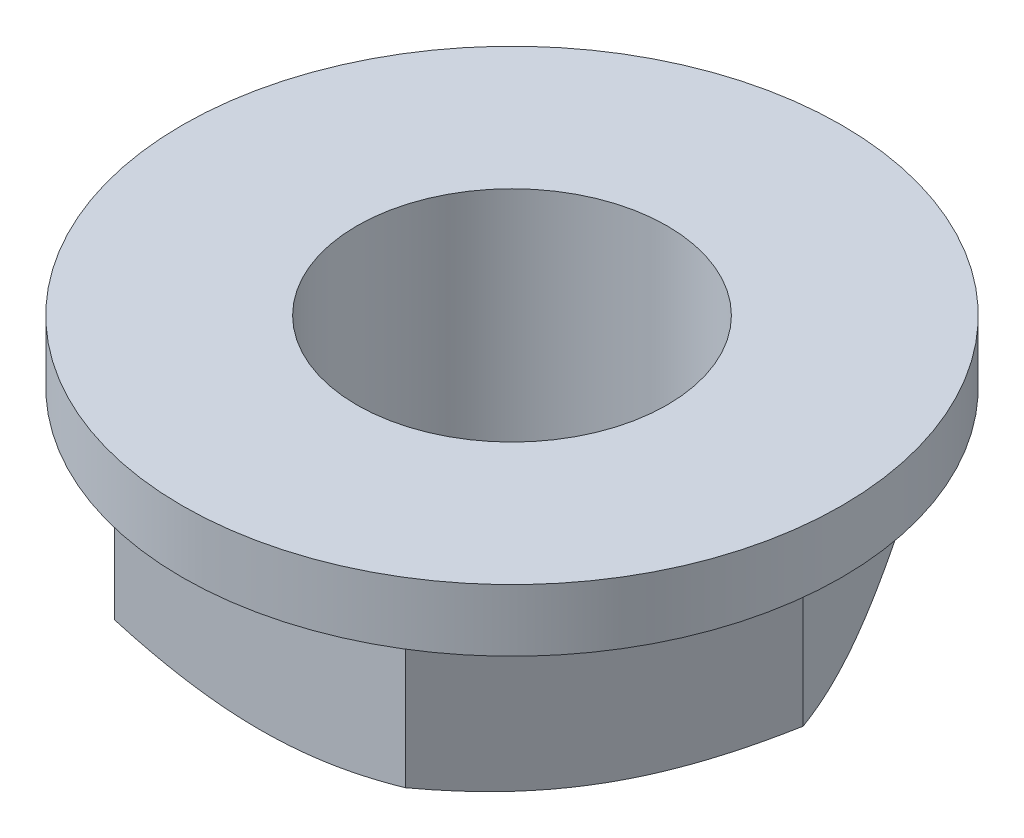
ISO-10303-21;
HEADER;
FILE_DESCRIPTION(('STEP AP214'),'2;1');
FILE_NAME('part.step','',(''),(''),'','','');
FILE_SCHEMA(('AUTOMOTIVE_DESIGN { 1 0 10303 214 1 1 1 1 }'));
ENDSEC;
DATA;
#1=APPLICATION_CONTEXT('core data for automotive mechanical design processes');
#2=APPLICATION_PROTOCOL_DEFINITION('international standard','automotive_design',2000,#1);
#3=PRODUCT_CONTEXT('',#1,'mechanical');
#4=PRODUCT('Part','Part','',(#3));
#5=PRODUCT_RELATED_PRODUCT_CATEGORY('part','',(#4));
#6=PRODUCT_DEFINITION_FORMATION('','',#4);
#7=PRODUCT_DEFINITION_CONTEXT('part definition',#1,'design');
#8=PRODUCT_DEFINITION('design','',#6,#7);
#9=PRODUCT_DEFINITION_SHAPE('','',#8);
#10=(LENGTH_UNIT() NAMED_UNIT(*) SI_UNIT(.MILLI.,.METRE.));
#11=(NAMED_UNIT(*) PLANE_ANGLE_UNIT() SI_UNIT($,.RADIAN.));
#12=(NAMED_UNIT(*) SI_UNIT($,.STERADIAN.) SOLID_ANGLE_UNIT());
#13=UNCERTAINTY_MEASURE_WITH_UNIT(LENGTH_MEASURE(1.E-05),#10,'distance_accuracy_value','');
#14=(GEOMETRIC_REPRESENTATION_CONTEXT(3) GLOBAL_UNCERTAINTY_ASSIGNED_CONTEXT((#13)) GLOBAL_UNIT_ASSIGNED_CONTEXT((#10,
#11,#12)) REPRESENTATION_CONTEXT('',''));
#15=CARTESIAN_POINT('',(0.,0.,0.));
#16=DIRECTION('',(0.,0.,1.));
#17=DIRECTION('',(1.,0.,0.));
#18=AXIS2_PLACEMENT_3D('',#15,#16,#17);
#19=CARTESIAN_POINT('',(-9.99200722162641E-12,-5.7091598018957,0.));
#20=DIRECTION('',(0.,1.,0.));
#21=DIRECTION('',(-1.,0.,0.));
#22=AXIS2_PLACEMENT_3D('',#19,#20,#21);
#23=CONICAL_SURFACE('',#22,7.00375,1.0471975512);
#24=CARTESIAN_POINT('',(0.,-6.00000000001,0.));
#25=DIRECTION('',(0.,-1.,0.));
#26=DIRECTION('',(-1.,0.,0.));
#27=AXIS2_PLACEMENT_3D('',#24,#25,#26);
#28=CIRCLE('',#27,6.5);
#29=CARTESIAN_POINT('',(-5.62916512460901,-6.,3.25));
#30=VERTEX_POINT('',#29);
#31=CARTESIAN_POINT('',(-5.62916512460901,-6.,-3.25));
#32=VERTEX_POINT('',#31);
#33=EDGE_CURVE('E267',#30,#32,#28,.T.);
#34=ORIENTED_EDGE('',*,*,#33,.F.);
#35=CARTESIAN_POINT('',(-5.62916512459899,-6.00000000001,3.25000000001));
#36=CARTESIAN_POINT('',(-6.5,-6.00000000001,1.74166975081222));
#37=CARTESIAN_POINT('',(-7.50555349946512,-5.4194434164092,-1.01469138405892E-11));
#38=(BOUNDED_CURVE() B_SPLINE_CURVE(2,(#35,#36,#37),.UNSPECIFIED.,.F.,
.F.) B_SPLINE_CURVE_WITH_KNOTS((3,3),(3.81115565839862,7.61876262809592),
.UNSPECIFIED.) CURVE() GEOMETRIC_REPRESENTATION_ITEM() RATIONAL_B_SPLINE_CURVE((1.,
1.0379915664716,1.0000707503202)) REPRESENTATION_ITEM(''));
#39=CARTESIAN_POINT('',(-7.50555349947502,-5.4194434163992,0.));
#40=VERTEX_POINT('',#39);
#41=EDGE_CURVE('E205',#30,#40,#38,.T.);
#42=ORIENTED_EDGE('',*,*,#41,.T.);
#43=CARTESIAN_POINT('',(-7.50555349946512,-5.4194434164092,1.01377498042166E-11));
#44=CARTESIAN_POINT('',(-6.49999999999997,-6.00000000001,-1.74166975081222));
#45=CARTESIAN_POINT('',(-5.62916512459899,-6.00000000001,-3.25000000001));
#46=(BOUNDED_CURVE() B_SPLINE_CURVE(2,(#43,#44,#45),.UNSPECIFIED.,.F.,
.F.) B_SPLINE_CURVE_WITH_KNOTS((3,3),(0.00354868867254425,3.81115565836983),
.UNSPECIFIED.) CURVE() GEOMETRIC_REPRESENTATION_ITEM() RATIONAL_B_SPLINE_CURVE((1.0000707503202,
1.03799156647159,1.)) REPRESENTATION_ITEM(''));
#47=EDGE_CURVE('E181',#40,#32,#46,.T.);
#48=ORIENTED_EDGE('',*,*,#47,.T.);
#49=EDGE_LOOP('',(#34,#42,#48));
#50=FACE_BOUND('',#49,.T.);
#51=ADVANCED_FACE('F15',(#50),#23,.T.);
#52=CARTESIAN_POINT('',(-9.99200722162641E-12,-0.8,0.));
#53=DIRECTION('',(0.,-1.,0.));
#54=DIRECTION('',(1.,0.,0.));
#55=AXIS2_PLACEMENT_3D('',#52,#53,#54);
#56=CYLINDRICAL_SURFACE('',#55,8.5);
#57=CARTESIAN_POINT('',(0.,-9.9998134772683E-12,0.));
#58=DIRECTION('',(0.,1.,0.));
#59=DIRECTION('',(1.,0.,0.));
#60=AXIS2_PLACEMENT_3D('',#57,#58,#59);
#61=CIRCLE('',#60,8.5);
#62=CARTESIAN_POINT('',(8.5,-9.9998134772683E-12,0.));
#63=VERTEX_POINT('',#62);
#64=EDGE_CURVE('E9',#63,#63,#61,.T.);
#65=ORIENTED_EDGE('',*,*,#64,.F.);
#66=EDGE_LOOP('',(#65));
#67=FACE_BOUND('',#66,.T.);
#68=CARTESIAN_POINT('',(0.,-1.60000000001,0.));
#69=DIRECTION('',(0.,1.,0.));
#70=DIRECTION('',(1.,0.,0.));
#71=AXIS2_PLACEMENT_3D('',#68,#69,#70);
#72=CIRCLE('',#71,8.5);
#73=CARTESIAN_POINT('',(8.5,-1.60000000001,0.));
#74=VERTEX_POINT('',#73);
#75=EDGE_CURVE('E198',#74,#74,#72,.T.);
#76=ORIENTED_EDGE('',*,*,#75,.T.);
#77=EDGE_LOOP('',(#76));
#78=FACE_BOUND('',#77,.T.);
#79=ADVANCED_FACE('F17',(#67,#78),#56,.T.);
#80=CARTESIAN_POINT('',(5.62916512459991,-6.00000000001,-3.25000000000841));
#81=CARTESIAN_POINT('',(6.49999999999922,-6.0000000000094,-1.74166975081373));
#82=CARTESIAN_POINT('',(7.50555349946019,-5.4194434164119,2.15975453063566E-12));
#83=(BOUNDED_CURVE() B_SPLINE_CURVE(2,(#80,#81,#82),.UNSPECIFIED.,.F.,
.F.) B_SPLINE_CURVE_WITH_KNOTS((3,3),(3.81115565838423,7.61876262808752),
.UNSPECIFIED.) CURVE() GEOMETRIC_REPRESENTATION_ITEM() RATIONAL_B_SPLINE_CURVE((1.00000000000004,
1.03799156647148,1.00007075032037)) REPRESENTATION_ITEM(''));
#84=CARTESIAN_POINT('',(5.629165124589,-6.,-3.25));
#85=VERTEX_POINT('',#84);
#86=CARTESIAN_POINT('',(7.505553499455,-5.4194434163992,0.));
#87=VERTEX_POINT('',#86);
#88=EDGE_CURVE('E113',#85,#87,#83,.T.);
#89=ORIENTED_EDGE('',*,*,#88,.T.);
#90=CARTESIAN_POINT('',(7.50555349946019,-5.4194434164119,-2.14848428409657E-12));
#91=CARTESIAN_POINT('',(6.49999999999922,-6.0000000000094,1.74166975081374));
#92=CARTESIAN_POINT('',(5.62916512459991,-6.00000000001,3.25000000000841));
#93=(BOUNDED_CURVE() B_SPLINE_CURVE(2,(#90,#91,#92),.UNSPECIFIED.,.F.,
.F.) B_SPLINE_CURVE_WITH_KNOTS((3,3),(0.00354868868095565,3.81115565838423),
.UNSPECIFIED.) CURVE() GEOMETRIC_REPRESENTATION_ITEM() RATIONAL_B_SPLINE_CURVE((1.00007075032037,
1.03799156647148,1.00000000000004)) REPRESENTATION_ITEM(''));
#94=CARTESIAN_POINT('',(5.629165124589,-6.,3.25));
#95=VERTEX_POINT('',#94);
#96=EDGE_CURVE('E28',#87,#95,#93,.T.);
#97=ORIENTED_EDGE('',*,*,#96,.T.);
#98=EDGE_CURVE('E257',#85,#95,#28,.T.);
#99=ORIENTED_EDGE('',*,*,#98,.F.);
#100=EDGE_LOOP('',(#89,#97,#99));
#101=FACE_BOUND('',#100,.T.);
#102=ADVANCED_FACE('F407',(#101),#23,.T.);
#103=CARTESIAN_POINT('',(-5.75375000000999,0.,0.));
#104=DIRECTION('',(0.,1.,0.));
#105=DIRECTION('',(1.,0.,0.));
#106=AXIS2_PLACEMENT_3D('',#103,#104,#105);
#107=PLANE('',#106);
#108=CARTESIAN_POINT('',(0.,0.,0.));
#109=DIRECTION('',(0.,1.,0.));
#110=DIRECTION('',(0.,0.,1.));
#111=AXIS2_PLACEMENT_3D('',#108,#109,#110);
#112=CIRCLE('',#111,4.);
#113=CARTESIAN_POINT('',(0.,0.,4.));
#114=VERTEX_POINT('',#113);
#115=EDGE_CURVE('E474',#114,#114,#112,.T.);
#116=ORIENTED_EDGE('',*,*,#115,.F.);
#117=EDGE_LOOP('',(#116));
#118=FACE_BOUND('',#117,.T.);
#119=ORIENTED_EDGE('',*,*,#64,.T.);
#120=EDGE_LOOP('',(#119));
#121=FACE_BOUND('',#120,.T.);
#122=ADVANCED_FACE('F394',(#118,#121),#107,.T.);
#123=CARTESIAN_POINT('',(5.629165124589,1.,3.25));
#124=DIRECTION('',(0.866025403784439,0.,0.5));
#125=DIRECTION('',(0.,-1.,0.));
#126=AXIS2_PLACEMENT_3D('',#123,#124,#125);
#127=PLANE('',#126);
#128=DIRECTION('',(-0.50000000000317,0.,0.866025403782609));
#129=VECTOR('',#128,1.);
#130=CARTESIAN_POINT('',(6.42291512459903,-1.60000000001,1.8751846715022));
#131=LINE('',#130,#129);
#132=CARTESIAN_POINT('',(7.505553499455,-1.6,0.));
#133=VERTEX_POINT('',#132);
#134=CARTESIAN_POINT('',(3.75277674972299,-1.6,6.5));
#135=VERTEX_POINT('',#134);
#136=EDGE_CURVE('E149',#133,#135,#131,.T.);
#137=ORIENTED_EDGE('',*,*,#136,.T.);
#138=DIRECTION('',(0.,-1.,0.));
#139=VECTOR('',#138,1.);
#140=CARTESIAN_POINT('',(3.75277674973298,0.99999999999,6.50000000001));
#141=LINE('',#140,#139);
#142=CARTESIAN_POINT('',(3.75277674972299,-5.4194434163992,6.5));
#143=VERTEX_POINT('',#142);
#144=EDGE_CURVE('E240',#135,#143,#141,.T.);
#145=ORIENTED_EDGE('',*,*,#144,.T.);
#146=CARTESIAN_POINT('',(5.62916512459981,-6.00000000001,3.25000000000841));
#147=CARTESIAN_POINT('',(4.75833024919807,-6.0000000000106,4.75833024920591));
#148=CARTESIAN_POINT('',(3.75277674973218,-5.41944341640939,6.50000000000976));
#149=(BOUNDED_CURVE() B_SPLINE_CURVE(2,(#146,#147,#148),.UNSPECIFIED.,.F.,
.F.) B_SPLINE_CURVE_WITH_KNOTS((3,3),(3.81115565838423,7.61876262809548),
.UNSPECIFIED.) CURVE() GEOMETRIC_REPRESENTATION_ITEM() RATIONAL_B_SPLINE_CURVE((0.999999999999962,
1.03799156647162,1.00007075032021)) REPRESENTATION_ITEM(''));
#150=EDGE_CURVE('E270',#95,#143,#149,.T.);
#151=ORIENTED_EDGE('',*,*,#150,.F.);
#152=ORIENTED_EDGE('',*,*,#96,.F.);
#153=DIRECTION('',(0.,-1.,0.));
#154=VECTOR('',#153,1.);
#155=CARTESIAN_POINT('',(7.50555349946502,0.99999999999,-1.00013787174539E-11));
#156=LINE('',#155,#154);
#157=EDGE_CURVE('E122',#133,#87,#156,.T.);
#158=ORIENTED_EDGE('',*,*,#157,.F.);
#159=EDGE_LOOP('',(#137,#145,#151,#152,#158));
#160=FACE_BOUND('',#159,.T.);
#161=ADVANCED_FACE('F341',(#160),#127,.T.);
#162=CARTESIAN_POINT('',(-5.25000000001,-6.,0.));
#163=DIRECTION('',(0.,-1.,0.));
#164=DIRECTION('',(-1.,0.,0.));
#165=AXIS2_PLACEMENT_3D('',#162,#163,#164);
#166=PLANE('',#165);
#167=CARTESIAN_POINT('',(0.,-6.,0.));
#168=DIRECTION('',(0.,-1.,0.));
#169=DIRECTION('',(1.,0.,0.));
#170=AXIS2_PLACEMENT_3D('',#167,#168,#169);
#171=CIRCLE('',#170,4.);
#172=CARTESIAN_POINT('',(4.,-6.,0.));
#173=VERTEX_POINT('',#172);
#174=EDGE_CURVE('E126',#173,#173,#171,.T.);
#175=ORIENTED_EDGE('',*,*,#174,.F.);
#176=EDGE_LOOP('',(#175));
#177=FACE_BOUND('',#176,.T.);
#178=CARTESIAN_POINT('',(-9.99200722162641E-12,-6.,6.5));
#179=VERTEX_POINT('',#178);
#180=EDGE_CURVE('E229',#179,#30,#28,.T.);
#181=ORIENTED_EDGE('',*,*,#180,.T.);
#182=ORIENTED_EDGE('',*,*,#33,.T.);
#183=CARTESIAN_POINT('',(-9.99200722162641E-12,-6.,-6.5));
#184=VERTEX_POINT('',#183);
#185=EDGE_CURVE('E165',#32,#184,#28,.T.);
#186=ORIENTED_EDGE('',*,*,#185,.T.);
#187=EDGE_CURVE('E94',#184,#85,#28,.T.);
#188=ORIENTED_EDGE('',*,*,#187,.T.);
#189=ORIENTED_EDGE('',*,*,#98,.T.);
#190=EDGE_CURVE('E252',#95,#179,#28,.T.);
#191=ORIENTED_EDGE('',*,*,#190,.T.);
#192=EDGE_LOOP('',(#181,#182,#186,#188,#189,#191));
#193=FACE_BOUND('',#192,.T.);
#194=ADVANCED_FACE('F337',(#177,#193),#166,.T.);
#195=CARTESIAN_POINT('',(3.75277674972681,-5.41944341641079,6.50000000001));
#196=CARTESIAN_POINT('',(1.74166975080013,-6.00000000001,6.50000000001));
#197=CARTESIAN_POINT('',(0.,-6.00000000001,6.50000000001));
#198=(BOUNDED_CURVE() B_SPLINE_CURVE(2,(#195,#196,#197),.UNSPECIFIED.,.F.,
.F.) B_SPLINE_CURVE_WITH_KNOTS((3,3),(0.00354868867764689,3.81115565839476),
.UNSPECIFIED.) CURVE() GEOMETRIC_REPRESENTATION_ITEM() RATIONAL_B_SPLINE_CURVE((1.00007075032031,
1.03799156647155,1.)) REPRESENTATION_ITEM(''));
#199=EDGE_CURVE('E217',#143,#179,#198,.T.);
#200=ORIENTED_EDGE('',*,*,#199,.T.);
#201=ORIENTED_EDGE('',*,*,#190,.F.);
#202=ORIENTED_EDGE('',*,*,#150,.T.);
#203=EDGE_LOOP('',(#200,#201,#202));
#204=FACE_BOUND('',#203,.T.);
#205=ADVANCED_FACE('F345',(#204),#23,.T.);
#206=CARTESIAN_POINT('',(0.,-6.00000000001,6.50000000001));
#207=CARTESIAN_POINT('',(-1.7416697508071,-6.00000000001,6.50000000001));
#208=CARTESIAN_POINT('',(-3.75277674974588,-5.41944341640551,6.50000000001));
#209=(BOUNDED_CURVE() B_SPLINE_CURVE(2,(#206,#207,#208),.UNSPECIFIED.,.F.,
.F.) B_SPLINE_CURVE_WITH_KNOTS((3,3),(3.81115565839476,7.61876262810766),
.UNSPECIFIED.) CURVE() GEOMETRIC_REPRESENTATION_ITEM() RATIONAL_B_SPLINE_CURVE((1.,
1.03799156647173,1.00007075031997)) REPRESENTATION_ITEM(''));
#210=CARTESIAN_POINT('',(-3.75277674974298,-5.4194434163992,6.5));
#211=VERTEX_POINT('',#210);
#212=EDGE_CURVE('E211',#179,#211,#209,.T.);
#213=ORIENTED_EDGE('',*,*,#212,.T.);
#214=CARTESIAN_POINT('',(-3.75277674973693,-5.41944341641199,6.50000000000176));
#215=CARTESIAN_POINT('',(-4.75833024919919,-6.00000000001,4.7583302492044));
#216=CARTESIAN_POINT('',(-5.62916512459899,-6.00000000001,3.25000000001));
#217=(BOUNDED_CURVE() B_SPLINE_CURVE(2,(#214,#215,#216),.UNSPECIFIED.,.F.,
.F.) B_SPLINE_CURVE_WITH_KNOTS((3,3),(0.00354868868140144,3.81115565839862),
.UNSPECIFIED.) CURVE() GEOMETRIC_REPRESENTATION_ITEM() RATIONAL_B_SPLINE_CURVE((1.00007075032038,
1.03799156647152,1.)) REPRESENTATION_ITEM(''));
#218=EDGE_CURVE('E222',#211,#30,#217,.T.);
#219=ORIENTED_EDGE('',*,*,#218,.T.);
#220=ORIENTED_EDGE('',*,*,#180,.F.);
#221=EDGE_LOOP('',(#213,#219,#220));
#222=FACE_BOUND('',#221,.T.);
#223=ADVANCED_FACE('F492',(#222),#23,.T.);
#224=CARTESIAN_POINT('',(-5.62916512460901,1.,3.25));
#225=DIRECTION('',(-0.866025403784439,0.,0.5));
#226=DIRECTION('',(0.,1.,0.));
#227=AXIS2_PLACEMENT_3D('',#224,#225,#226);
#228=PLANE('',#227);
#229=DIRECTION('',(-0.50000000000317,0.,-0.866025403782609));
#230=VECTOR('',#229,1.);
#231=CARTESIAN_POINT('',(-4.83541512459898,-1.60000000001,4.62481532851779));
#232=LINE('',#231,#230);
#233=CARTESIAN_POINT('',(-3.75277674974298,-1.6,6.5));
#234=VERTEX_POINT('',#233);
#235=CARTESIAN_POINT('',(-7.50555349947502,-1.6,0.));
#236=VERTEX_POINT('',#235);
#237=EDGE_CURVE('E191',#234,#236,#232,.T.);
#238=ORIENTED_EDGE('',*,*,#237,.T.);
#239=DIRECTION('',(0.,-1.,0.));
#240=VECTOR('',#239,1.);
#241=CARTESIAN_POINT('',(-7.505553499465,0.99999999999,1.00004595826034E-11));
#242=LINE('',#241,#240);
#243=EDGE_CURVE('E201',#236,#40,#242,.T.);
#244=ORIENTED_EDGE('',*,*,#243,.T.);
#245=ORIENTED_EDGE('',*,*,#41,.F.);
#246=ORIENTED_EDGE('',*,*,#218,.F.);
#247=DIRECTION('',(0.,-1.,0.));
#248=VECTOR('',#247,1.);
#249=CARTESIAN_POINT('',(-3.75277674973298,0.99999999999,6.50000000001));
#250=LINE('',#249,#248);
#251=EDGE_CURVE('E138',#234,#211,#250,.T.);
#252=ORIENTED_EDGE('',*,*,#251,.F.);
#253=EDGE_LOOP('',(#238,#244,#245,#246,#252));
#254=FACE_BOUND('',#253,.T.);
#255=ADVANCED_FACE('F498',(#254),#228,.T.);
#256=CARTESIAN_POINT('',(-5.62916512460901,1.,-3.25));
#257=DIRECTION('',(-0.866025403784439,0.,-0.5));
#258=DIRECTION('',(-0.5,0.,0.866025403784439));
#259=AXIS2_PLACEMENT_3D('',#256,#257,#258);
#260=PLANE('',#259);
#261=DIRECTION('',(0.50000000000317,0.,-0.866025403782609));
#262=VECTOR('',#261,1.);
#263=CARTESIAN_POINT('',(-4.83541512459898,-1.60000000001,-4.62481532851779));
#264=LINE('',#263,#262);
#265=CARTESIAN_POINT('',(-3.75277674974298,-1.6,-6.5));
#266=VERTEX_POINT('',#265);
#267=EDGE_CURVE('E148',#236,#266,#264,.T.);
#268=ORIENTED_EDGE('',*,*,#267,.T.);
#269=DIRECTION('',(0.,-1.,0.));
#270=VECTOR('',#269,1.);
#271=CARTESIAN_POINT('',(-3.75277674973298,0.99999999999,-6.50000000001));
#272=LINE('',#271,#270);
#273=CARTESIAN_POINT('',(-3.75277674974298,-5.4194434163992,-6.5));
#274=VERTEX_POINT('',#273);
#275=EDGE_CURVE('E176',#266,#274,#272,.T.);
#276=ORIENTED_EDGE('',*,*,#275,.T.);
#277=CARTESIAN_POINT('',(-5.62916512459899,-6.00000000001,-3.25000000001));
#278=CARTESIAN_POINT('',(-4.75833024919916,-6.00000000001,-4.7583302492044));
#279=CARTESIAN_POINT('',(-3.75277674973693,-5.41944341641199,-6.50000000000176));
#280=(BOUNDED_CURVE() B_SPLINE_CURVE(2,(#277,#278,#279),.UNSPECIFIED.,.F.,
.F.) B_SPLINE_CURVE_WITH_KNOTS((3,3),(3.81115565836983,7.61876262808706),
.UNSPECIFIED.) CURVE() GEOMETRIC_REPRESENTATION_ITEM() RATIONAL_B_SPLINE_CURVE((1.,
1.03799156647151,1.00007075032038)) REPRESENTATION_ITEM(''));
#281=EDGE_CURVE('E98',#32,#274,#280,.T.);
#282=ORIENTED_EDGE('',*,*,#281,.F.);
#283=ORIENTED_EDGE('',*,*,#47,.F.);
#284=ORIENTED_EDGE('',*,*,#243,.F.);
#285=EDGE_LOOP('',(#268,#276,#282,#283,#284));
#286=FACE_BOUND('',#285,.T.);
#287=ADVANCED_FACE('F294',(#286),#260,.T.);
#288=CARTESIAN_POINT('',(-9.99200722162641E-12,1.,-6.5));
#289=DIRECTION('',(0.,0.,-1.));
#290=DIRECTION('',(0.,-1.,0.));
#291=AXIS2_PLACEMENT_3D('',#288,#289,#290);
#292=PLANE('',#291);
#293=DIRECTION('',(1.,0.,0.));
#294=VECTOR('',#293,1.);
#295=CARTESIAN_POINT('',(3.175,-1.60000000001,-6.50000000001));
#296=LINE('',#295,#294);
#297=CARTESIAN_POINT('',(3.75277674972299,-1.6,-6.5));
#298=VERTEX_POINT('',#297);
#299=EDGE_CURVE('E104',#266,#298,#296,.T.);
#300=ORIENTED_EDGE('',*,*,#299,.T.);
#301=DIRECTION('',(0.,-1.,0.));
#302=VECTOR('',#301,1.);
#303=CARTESIAN_POINT('',(3.75277674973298,0.99999999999,-6.50000000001));
#304=LINE('',#303,#302);
#305=CARTESIAN_POINT('',(3.75277674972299,-5.4194434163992,-6.5));
#306=VERTEX_POINT('',#305);
#307=EDGE_CURVE('E101',#298,#306,#304,.T.);
#308=ORIENTED_EDGE('',*,*,#307,.T.);
#309=CARTESIAN_POINT('',(0.,-6.00000000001,-6.50000000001));
#310=CARTESIAN_POINT('',(1.74166975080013,-6.00000000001,-6.50000000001));
#311=CARTESIAN_POINT('',(3.75277674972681,-5.41944341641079,-6.50000000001));
#312=(BOUNDED_CURVE() B_SPLINE_CURVE(2,(#309,#310,#311),.UNSPECIFIED.,.F.,
.F.) B_SPLINE_CURVE_WITH_KNOTS((3,3),(3.81115565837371,7.61876262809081),
.UNSPECIFIED.) CURVE() GEOMETRIC_REPRESENTATION_ITEM() RATIONAL_B_SPLINE_CURVE((1.,
1.03799156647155,1.00007075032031)) REPRESENTATION_ITEM(''));
#313=EDGE_CURVE('E87',#184,#306,#312,.T.);
#314=ORIENTED_EDGE('',*,*,#313,.F.);
#315=CARTESIAN_POINT('',(-3.75277674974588,-5.41944341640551,-6.50000000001));
#316=CARTESIAN_POINT('',(-1.74166975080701,-6.00000000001,-6.50000000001));
#317=CARTESIAN_POINT('',(0.,-6.00000000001,-6.50000000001));
#318=(BOUNDED_CURVE() B_SPLINE_CURVE(2,(#315,#316,#317),.UNSPECIFIED.,.F.,
.F.) B_SPLINE_CURVE_WITH_KNOTS((3,3),(0.00354868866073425,3.81115565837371),
.UNSPECIFIED.) CURVE() GEOMETRIC_REPRESENTATION_ITEM() RATIONAL_B_SPLINE_CURVE((1.00007075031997,
1.03799156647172,1.)) REPRESENTATION_ITEM(''));
#319=EDGE_CURVE('E158',#274,#184,#318,.T.);
#320=ORIENTED_EDGE('',*,*,#319,.F.);
#321=ORIENTED_EDGE('',*,*,#275,.F.);
#322=EDGE_LOOP('',(#300,#308,#314,#320,#321));
#323=FACE_BOUND('',#322,.T.);
#324=ADVANCED_FACE('F102',(#323),#292,.T.);
#325=CARTESIAN_POINT('',(6.34999999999,-1.6,0.));
#326=DIRECTION('',(0.,-1.,0.));
#327=DIRECTION('',(0.,0.,-1.));
#328=AXIS2_PLACEMENT_3D('',#325,#326,#327);
#329=PLANE('',#328);
#330=ORIENTED_EDGE('',*,*,#237,.F.);
#331=DIRECTION('',(-1.,0.,0.));
#332=VECTOR('',#331,1.);
#333=CARTESIAN_POINT('',(3.175,-1.60000000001,6.50000000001));
#334=LINE('',#333,#332);
#335=EDGE_CURVE('E109',#135,#234,#334,.T.);
#336=ORIENTED_EDGE('',*,*,#335,.F.);
#337=ORIENTED_EDGE('',*,*,#136,.F.);
#338=DIRECTION('',(0.50000000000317,0.,0.866025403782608));
#339=VECTOR('',#338,1.);
#340=CARTESIAN_POINT('',(6.42291512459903,-1.60000000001,-1.8751846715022));
#341=LINE('',#340,#339);
#342=EDGE_CURVE('E141',#298,#133,#341,.T.);
#343=ORIENTED_EDGE('',*,*,#342,.F.);
#344=ORIENTED_EDGE('',*,*,#299,.F.);
#345=ORIENTED_EDGE('',*,*,#267,.F.);
#346=EDGE_LOOP('',(#330,#336,#337,#343,#344,#345));
#347=FACE_BOUND('',#346,.T.);
#348=ORIENTED_EDGE('',*,*,#75,.F.);
#349=EDGE_LOOP('',(#348));
#350=FACE_BOUND('',#349,.T.);
#351=ADVANCED_FACE('F297',(#347,#350),#329,.T.);
#352=ORIENTED_EDGE('',*,*,#281,.T.);
#353=ORIENTED_EDGE('',*,*,#319,.T.);
#354=ORIENTED_EDGE('',*,*,#185,.F.);
#355=EDGE_LOOP('',(#352,#353,#354));
#356=FACE_BOUND('',#355,.T.);
#357=ADVANCED_FACE('F291',(#356),#23,.T.);
#358=CARTESIAN_POINT('',(3.75277674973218,-5.41944341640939,-6.50000000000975));
#359=CARTESIAN_POINT('',(4.75833024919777,-6.0000000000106,-4.75833024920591));
#360=CARTESIAN_POINT('',(5.62916512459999,-6.00000000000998,-3.25000000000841));
#361=(BOUNDED_CURVE() B_SPLINE_CURVE(2,(#358,#359,#360),.UNSPECIFIED.,.F.,
.F.) B_SPLINE_CURVE_WITH_KNOTS((3,3),(0.00354868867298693,3.81115565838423),
.UNSPECIFIED.) CURVE() GEOMETRIC_REPRESENTATION_ITEM() RATIONAL_B_SPLINE_CURVE((1.00007075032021,
1.03799156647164,0.999999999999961)) REPRESENTATION_ITEM(''));
#362=EDGE_CURVE('E91',#306,#85,#361,.T.);
#363=ORIENTED_EDGE('',*,*,#362,.T.);
#364=ORIENTED_EDGE('',*,*,#187,.F.);
#365=ORIENTED_EDGE('',*,*,#313,.T.);
#366=EDGE_LOOP('',(#363,#364,#365));
#367=FACE_BOUND('',#366,.T.);
#368=ADVANCED_FACE('F89',(#367),#23,.T.);
#369=CARTESIAN_POINT('',(-9.99200722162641E-12,1.,6.5));
#370=DIRECTION('',(0.,0.,1.));
#371=DIRECTION('',(1.,0.,0.));
#372=AXIS2_PLACEMENT_3D('',#369,#370,#371);
#373=PLANE('',#372);
#374=ORIENTED_EDGE('',*,*,#335,.T.);
#375=ORIENTED_EDGE('',*,*,#251,.T.);
#376=ORIENTED_EDGE('',*,*,#212,.F.);
#377=ORIENTED_EDGE('',*,*,#199,.F.);
#378=ORIENTED_EDGE('',*,*,#144,.F.);
#379=EDGE_LOOP('',(#374,#375,#376,#377,#378));
#380=FACE_BOUND('',#379,.T.);
#381=ADVANCED_FACE('F508',(#380),#373,.T.);
#382=CARTESIAN_POINT('',(5.629165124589,1.,-3.25));
#383=DIRECTION('',(0.866025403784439,0.,-0.5));
#384=DIRECTION('',(0.,-1.,0.));
#385=AXIS2_PLACEMENT_3D('',#382,#383,#384);
#386=PLANE('',#385);
#387=ORIENTED_EDGE('',*,*,#342,.T.);
#388=ORIENTED_EDGE('',*,*,#157,.T.);
#389=ORIENTED_EDGE('',*,*,#88,.F.);
#390=ORIENTED_EDGE('',*,*,#362,.F.);
#391=ORIENTED_EDGE('',*,*,#307,.F.);
#392=EDGE_LOOP('',(#387,#388,#389,#390,#391));
#393=FACE_BOUND('',#392,.T.);
#394=ADVANCED_FACE('F111',(#393),#386,.T.);
#395=CARTESIAN_POINT('',(0.,-6.0025,0.));
#396=DIRECTION('',(0.,1.,0.));
#397=DIRECTION('',(0.,0.,1.));
#398=AXIS2_PLACEMENT_3D('',#395,#396,#397);
#399=CYLINDRICAL_SURFACE('',#398,4.);
#400=ORIENTED_EDGE('',*,*,#174,.T.);
#401=EDGE_LOOP('',(#400));
#402=FACE_BOUND('',#401,.T.);
#403=ORIENTED_EDGE('',*,*,#115,.T.);
#404=EDGE_LOOP('',(#403));
#405=FACE_BOUND('',#404,.T.);
#406=ADVANCED_FACE('F479',(#402,#405),#399,.F.);
#407=CLOSED_SHELL('',(#51,#79,#102,#122,#161,#194,#205,#223,#255,#287,#324,#351,#357,#368,#381,
#394,#406));
#408=MANIFOLD_SOLID_BREP('B1',#407);
#409=ADVANCED_BREP_SHAPE_REPRESENTATION('',(#18,#408),#14);
#410=SHAPE_DEFINITION_REPRESENTATION(#9,#409);
ENDSEC;
END-ISO-10303-21;
